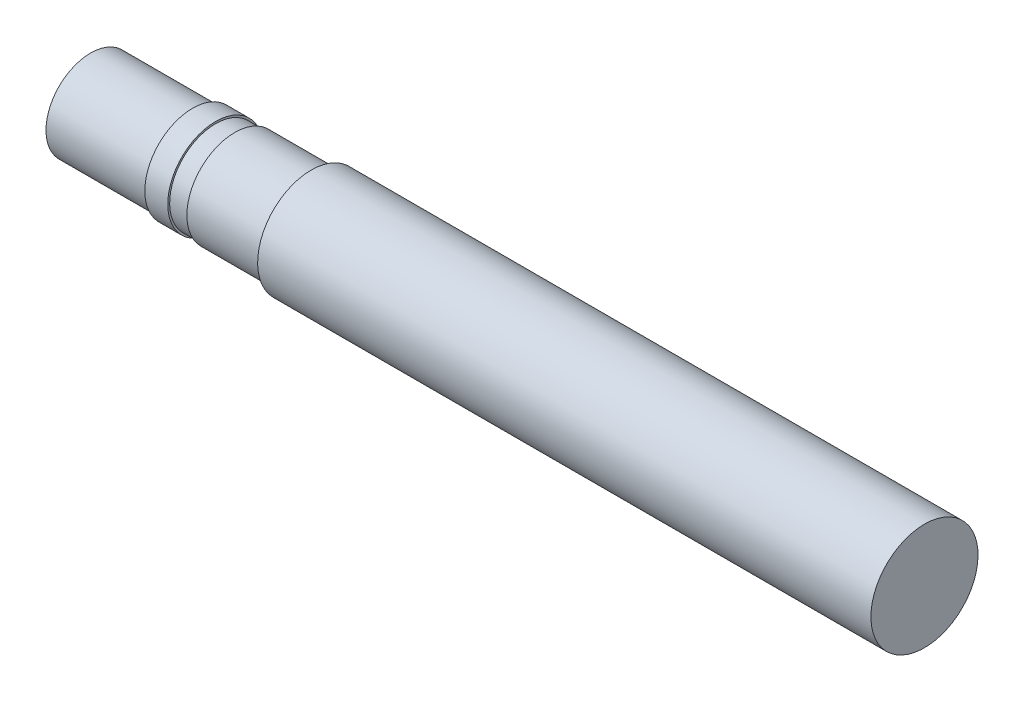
ISO-10303-21;
HEADER;
FILE_DESCRIPTION(('STEP AP214'),'2;1');
FILE_NAME('part.step','',(''),(''),'','','');
FILE_SCHEMA(('AUTOMOTIVE_DESIGN { 1 0 10303 214 1 1 1 1 }'));
ENDSEC;
DATA;
#1=APPLICATION_CONTEXT('core data for automotive mechanical design processes');
#2=APPLICATION_PROTOCOL_DEFINITION('international standard','automotive_design',2000,#1);
#3=PRODUCT_CONTEXT('',#1,'mechanical');
#4=PRODUCT('Part','Part','',(#3));
#5=PRODUCT_RELATED_PRODUCT_CATEGORY('part','',(#4));
#6=PRODUCT_DEFINITION_FORMATION('','',#4);
#7=PRODUCT_DEFINITION_CONTEXT('part definition',#1,'design');
#8=PRODUCT_DEFINITION('design','',#6,#7);
#9=PRODUCT_DEFINITION_SHAPE('','',#8);
#10=(LENGTH_UNIT() NAMED_UNIT(*) SI_UNIT(.MILLI.,.METRE.));
#11=(NAMED_UNIT(*) PLANE_ANGLE_UNIT() SI_UNIT($,.RADIAN.));
#12=(NAMED_UNIT(*) SI_UNIT($,.STERADIAN.) SOLID_ANGLE_UNIT());
#13=UNCERTAINTY_MEASURE_WITH_UNIT(LENGTH_MEASURE(1.E-05),#10,'distance_accuracy_value','');
#14=(GEOMETRIC_REPRESENTATION_CONTEXT(3) GLOBAL_UNCERTAINTY_ASSIGNED_CONTEXT((#13)) GLOBAL_UNIT_ASSIGNED_CONTEXT((#10,
#11,#12)) REPRESENTATION_CONTEXT('',''));
#15=CARTESIAN_POINT('',(0.,0.,0.));
#16=DIRECTION('',(0.,0.,1.));
#17=DIRECTION('',(1.,0.,0.));
#18=AXIS2_PLACEMENT_3D('',#15,#16,#17);
#19=CARTESIAN_POINT('',(-556.,37.4999999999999,0.));
#20=DIRECTION('',(1.,0.,0.));
#21=DIRECTION('',(0.,1.,0.));
#22=AXIS2_PLACEMENT_3D('',#19,#20,#21);
#23=PLANE('',#22);
#24=CARTESIAN_POINT('',(-556.,0.,0.));
#25=DIRECTION('',(1.,0.,0.));
#26=DIRECTION('',(0.,1.,0.));
#27=AXIS2_PLACEMENT_3D('',#24,#25,#26);
#28=CIRCLE('',#27,37.5);
#29=CARTESIAN_POINT('',(-556.,37.4999999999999,0.));
#30=VERTEX_POINT('',#29);
#31=EDGE_CURVE('E10',#30,#30,#28,.T.);
#32=ORIENTED_EDGE('',*,*,#31,.T.);
#33=EDGE_LOOP('',(#32));
#34=FACE_BOUND('',#33,.T.);
#35=CARTESIAN_POINT('',(-556.,0.,0.));
#36=DIRECTION('',(1.,0.,0.));
#37=DIRECTION('',(0.,1.,0.));
#38=AXIS2_PLACEMENT_3D('',#35,#36,#37);
#39=CIRCLE('',#38,36.);
#40=CARTESIAN_POINT('',(-556.,35.9999999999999,0.));
#41=VERTEX_POINT('',#40);
#42=EDGE_CURVE('E64',#41,#41,#39,.T.);
#43=ORIENTED_EDGE('',*,*,#42,.F.);
#44=EDGE_LOOP('',(#43));
#45=FACE_BOUND('',#44,.T.);
#46=ADVANCED_FACE('F30',(#34,#45),#23,.T.);
#47=CARTESIAN_POINT('',(0.,0.,0.));
#48=DIRECTION('',(1.,0.,0.));
#49=DIRECTION('',(0.,1.,0.));
#50=AXIS2_PLACEMENT_3D('',#47,#48,#49);
#51=CYLINDRICAL_SURFACE('',#50,37.5);
#52=CARTESIAN_POINT('',(-574.,0.,0.));
#53=DIRECTION('',(1.,0.,0.));
#54=DIRECTION('',(0.,1.,0.));
#55=AXIS2_PLACEMENT_3D('',#52,#53,#54);
#56=CIRCLE('',#55,37.5);
#57=CARTESIAN_POINT('',(-574.,37.4999999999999,0.));
#58=VERTEX_POINT('',#57);
#59=EDGE_CURVE('E36',#58,#58,#56,.T.);
#60=ORIENTED_EDGE('',*,*,#59,.T.);
#61=EDGE_LOOP('',(#60));
#62=FACE_BOUND('',#61,.T.);
#63=ORIENTED_EDGE('',*,*,#31,.F.);
#64=EDGE_LOOP('',(#63));
#65=FACE_BOUND('',#64,.T.);
#66=ADVANCED_FACE('F72',(#62,#65),#51,.T.);
#67=CARTESIAN_POINT('',(-574.,37.4999999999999,0.));
#68=DIRECTION('',(-1.,0.,0.));
#69=DIRECTION('',(0.,-1.,0.));
#70=AXIS2_PLACEMENT_3D('',#67,#68,#69);
#71=PLANE('',#70);
#72=CARTESIAN_POINT('',(-574.,0.,0.));
#73=DIRECTION('',(1.,0.,0.));
#74=DIRECTION('',(0.,1.,0.));
#75=AXIS2_PLACEMENT_3D('',#72,#73,#74);
#76=CIRCLE('',#75,35.);
#77=CARTESIAN_POINT('',(-574.,34.9999999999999,0.));
#78=VERTEX_POINT('',#77);
#79=EDGE_CURVE('E40',#78,#78,#76,.T.);
#80=ORIENTED_EDGE('',*,*,#79,.T.);
#81=EDGE_LOOP('',(#80));
#82=FACE_BOUND('',#81,.T.);
#83=ORIENTED_EDGE('',*,*,#59,.F.);
#84=EDGE_LOOP('',(#83));
#85=FACE_BOUND('',#84,.T.);
#86=ADVANCED_FACE('F76',(#82,#85),#71,.T.);
#87=CARTESIAN_POINT('',(0.,0.,0.));
#88=DIRECTION('',(1.,0.,0.));
#89=DIRECTION('',(0.,1.,0.));
#90=AXIS2_PLACEMENT_3D('',#87,#88,#89);
#91=CYLINDRICAL_SURFACE('',#90,35.);
#92=CARTESIAN_POINT('',(-654.,0.,0.));
#93=DIRECTION('',(1.,0.,0.));
#94=DIRECTION('',(0.,1.,0.));
#95=AXIS2_PLACEMENT_3D('',#92,#93,#94);
#96=CIRCLE('',#95,35.);
#97=CARTESIAN_POINT('',(-654.,34.9999999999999,0.));
#98=VERTEX_POINT('',#97);
#99=EDGE_CURVE('E44',#98,#98,#96,.T.);
#100=ORIENTED_EDGE('',*,*,#99,.T.);
#101=EDGE_LOOP('',(#100));
#102=FACE_BOUND('',#101,.T.);
#103=ORIENTED_EDGE('',*,*,#79,.F.);
#104=EDGE_LOOP('',(#103));
#105=FACE_BOUND('',#104,.T.);
#106=ADVANCED_FACE('F80',(#102,#105),#91,.T.);
#107=CARTESIAN_POINT('',(-654.,0.,0.));
#108=DIRECTION('',(-1.,0.,0.));
#109=DIRECTION('',(0.,-1.,0.));
#110=AXIS2_PLACEMENT_3D('',#107,#108,#109);
#111=PLANE('',#110);
#112=ORIENTED_EDGE('',*,*,#99,.F.);
#113=EDGE_LOOP('',(#112));
#114=FACE_BOUND('',#113,.T.);
#115=ADVANCED_FACE('F87',(#114),#111,.T.);
#116=CARTESIAN_POINT('',(0.,42.,0.));
#117=DIRECTION('',(1.,0.,0.));
#118=DIRECTION('',(0.,1.,0.));
#119=AXIS2_PLACEMENT_3D('',#116,#117,#118);
#120=PLANE('',#119);
#121=CARTESIAN_POINT('',(0.,0.,0.));
#122=DIRECTION('',(1.,0.,0.));
#123=DIRECTION('',(0.,1.,0.));
#124=AXIS2_PLACEMENT_3D('',#121,#122,#123);
#125=CIRCLE('',#124,42.);
#126=CARTESIAN_POINT('',(0.,42.,0.));
#127=VERTEX_POINT('',#126);
#128=EDGE_CURVE('E49',#127,#127,#125,.T.);
#129=ORIENTED_EDGE('',*,*,#128,.T.);
#130=EDGE_LOOP('',(#129));
#131=FACE_BOUND('',#130,.T.);
#132=ADVANCED_FACE('F91',(#131),#120,.T.);
#133=CARTESIAN_POINT('',(0.,0.,0.));
#134=DIRECTION('',(1.,0.,0.));
#135=DIRECTION('',(0.,1.,0.));
#136=AXIS2_PLACEMENT_3D('',#133,#134,#135);
#137=CYLINDRICAL_SURFACE('',#136,42.);
#138=CARTESIAN_POINT('',(-481.,0.,0.));
#139=DIRECTION('',(1.,0.,0.));
#140=DIRECTION('',(0.,1.,0.));
#141=AXIS2_PLACEMENT_3D('',#138,#139,#140);
#142=CIRCLE('',#141,42.0000000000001);
#143=CARTESIAN_POINT('',(-481.,42.,0.));
#144=VERTEX_POINT('',#143);
#145=EDGE_CURVE('E52',#144,#144,#142,.T.);
#146=ORIENTED_EDGE('',*,*,#145,.T.);
#147=EDGE_LOOP('',(#146));
#148=FACE_BOUND('',#147,.T.);
#149=ORIENTED_EDGE('',*,*,#128,.F.);
#150=EDGE_LOOP('',(#149));
#151=FACE_BOUND('',#150,.T.);
#152=ADVANCED_FACE('F95',(#148,#151),#137,.T.);
#153=CARTESIAN_POINT('',(-481.,37.4999999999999,0.));
#154=DIRECTION('',(-1.,0.,0.));
#155=DIRECTION('',(0.,-1.,0.));
#156=AXIS2_PLACEMENT_3D('',#153,#154,#155);
#157=PLANE('',#156);
#158=CARTESIAN_POINT('',(-481.,0.,0.));
#159=DIRECTION('',(1.,0.,0.));
#160=DIRECTION('',(0.,1.,0.));
#161=AXIS2_PLACEMENT_3D('',#158,#159,#160);
#162=CIRCLE('',#161,37.5);
#163=CARTESIAN_POINT('',(-481.,37.4999999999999,0.));
#164=VERTEX_POINT('',#163);
#165=EDGE_CURVE('E55',#164,#164,#162,.T.);
#166=ORIENTED_EDGE('',*,*,#165,.T.);
#167=EDGE_LOOP('',(#166));
#168=FACE_BOUND('',#167,.T.);
#169=ORIENTED_EDGE('',*,*,#145,.F.);
#170=EDGE_LOOP('',(#169));
#171=FACE_BOUND('',#170,.T.);
#172=ADVANCED_FACE('F99',(#168,#171),#157,.T.);
#173=CARTESIAN_POINT('',(0.,0.,0.));
#174=DIRECTION('',(1.,0.,0.));
#175=DIRECTION('',(0.,1.,0.));
#176=AXIS2_PLACEMENT_3D('',#173,#174,#175);
#177=CYLINDRICAL_SURFACE('',#176,37.5);
#178=CARTESIAN_POINT('',(-541.,0.,0.));
#179=DIRECTION('',(1.,0.,0.));
#180=DIRECTION('',(0.,1.,0.));
#181=AXIS2_PLACEMENT_3D('',#178,#179,#180);
#182=CIRCLE('',#181,37.5);
#183=CARTESIAN_POINT('',(-541.,37.4999999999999,0.));
#184=VERTEX_POINT('',#183);
#185=EDGE_CURVE('E58',#184,#184,#182,.T.);
#186=ORIENTED_EDGE('',*,*,#185,.T.);
#187=EDGE_LOOP('',(#186));
#188=FACE_BOUND('',#187,.T.);
#189=ORIENTED_EDGE('',*,*,#165,.F.);
#190=EDGE_LOOP('',(#189));
#191=FACE_BOUND('',#190,.T.);
#192=ADVANCED_FACE('F103',(#188,#191),#177,.T.);
#193=CARTESIAN_POINT('',(-541.,35.9999999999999,0.));
#194=DIRECTION('',(-1.,0.,0.));
#195=DIRECTION('',(0.,-1.,0.));
#196=AXIS2_PLACEMENT_3D('',#193,#194,#195);
#197=PLANE('',#196);
#198=CARTESIAN_POINT('',(-541.,0.,0.));
#199=DIRECTION('',(1.,0.,0.));
#200=DIRECTION('',(0.,1.,0.));
#201=AXIS2_PLACEMENT_3D('',#198,#199,#200);
#202=CIRCLE('',#201,36.);
#203=CARTESIAN_POINT('',(-541.,35.9999999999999,0.));
#204=VERTEX_POINT('',#203);
#205=EDGE_CURVE('E61',#204,#204,#202,.T.);
#206=ORIENTED_EDGE('',*,*,#205,.T.);
#207=EDGE_LOOP('',(#206));
#208=FACE_BOUND('',#207,.T.);
#209=ORIENTED_EDGE('',*,*,#185,.F.);
#210=EDGE_LOOP('',(#209));
#211=FACE_BOUND('',#210,.T.);
#212=ADVANCED_FACE('F107',(#208,#211),#197,.T.);
#213=CARTESIAN_POINT('',(0.,0.,0.));
#214=DIRECTION('',(1.,0.,0.));
#215=DIRECTION('',(0.,1.,0.));
#216=AXIS2_PLACEMENT_3D('',#213,#214,#215);
#217=CYLINDRICAL_SURFACE('',#216,36.);
#218=ORIENTED_EDGE('',*,*,#42,.T.);
#219=EDGE_LOOP('',(#218));
#220=FACE_BOUND('',#219,.T.);
#221=ORIENTED_EDGE('',*,*,#205,.F.);
#222=EDGE_LOOP('',(#221));
#223=FACE_BOUND('',#222,.T.);
#224=ADVANCED_FACE('F68',(#220,#223),#217,.T.);
#225=CLOSED_SHELL('',(#46,#66,#86,#106,#115,#132,#152,#172,#192,#212,#224));
#226=MANIFOLD_SOLID_BREP('B2',#225);
#227=ADVANCED_BREP_SHAPE_REPRESENTATION('',(#18,#226),#14);
#228=SHAPE_DEFINITION_REPRESENTATION(#9,#227);
ENDSEC;
END-ISO-10303-21;
